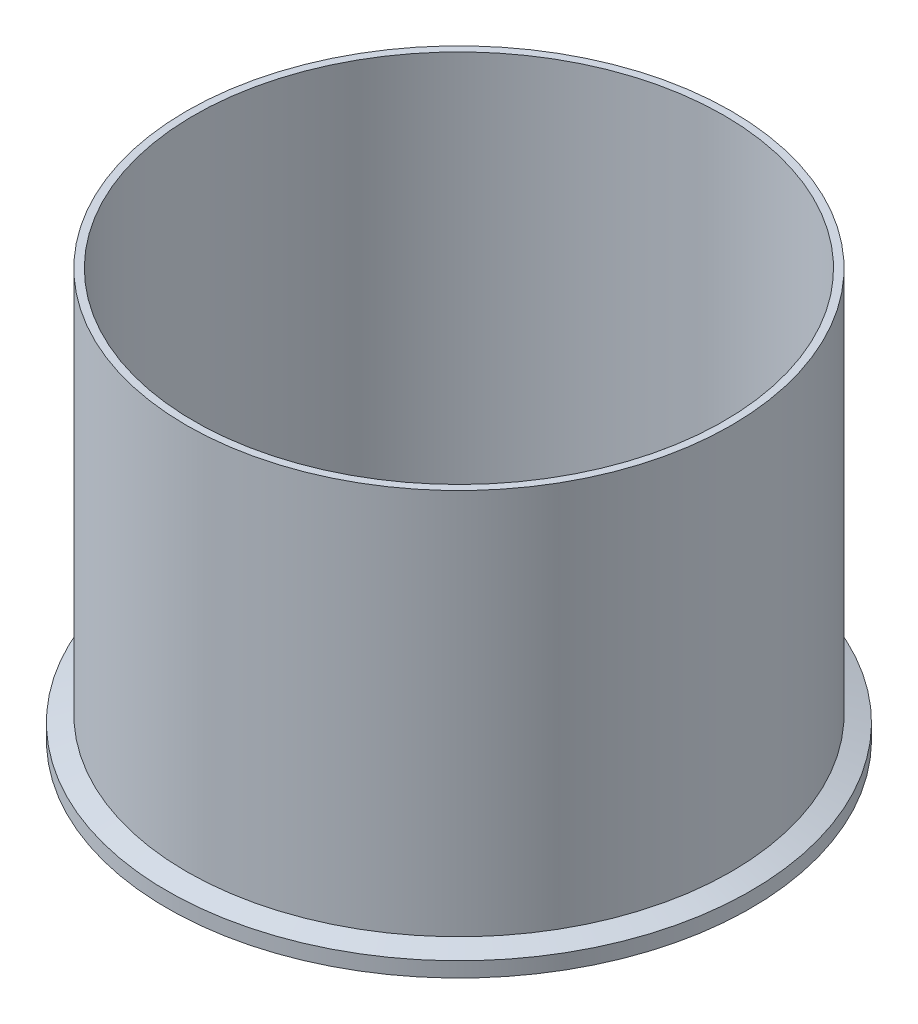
ISO-10303-21;
HEADER;
FILE_DESCRIPTION(('STEP AP214'),'2;1');
FILE_NAME('part.step','',(''),(''),'','','');
FILE_SCHEMA(('AUTOMOTIVE_DESIGN { 1 0 10303 214 1 1 1 1 }'));
ENDSEC;
DATA;
#1=APPLICATION_CONTEXT('core data for automotive mechanical design processes');
#2=APPLICATION_PROTOCOL_DEFINITION('international standard','automotive_design',2000,#1);
#3=PRODUCT_CONTEXT('',#1,'mechanical');
#4=PRODUCT('Part','Part','',(#3));
#5=PRODUCT_RELATED_PRODUCT_CATEGORY('part','',(#4));
#6=PRODUCT_DEFINITION_FORMATION('','',#4);
#7=PRODUCT_DEFINITION_CONTEXT('part definition',#1,'design');
#8=PRODUCT_DEFINITION('design','',#6,#7);
#9=PRODUCT_DEFINITION_SHAPE('','',#8);
#10=(LENGTH_UNIT() NAMED_UNIT(*) SI_UNIT(.MILLI.,.METRE.));
#11=(NAMED_UNIT(*) PLANE_ANGLE_UNIT() SI_UNIT($,.RADIAN.));
#12=(NAMED_UNIT(*) SI_UNIT($,.STERADIAN.) SOLID_ANGLE_UNIT());
#13=UNCERTAINTY_MEASURE_WITH_UNIT(LENGTH_MEASURE(1.E-05),#10,'distance_accuracy_value','');
#14=(GEOMETRIC_REPRESENTATION_CONTEXT(3) GLOBAL_UNCERTAINTY_ASSIGNED_CONTEXT((#13)) GLOBAL_UNIT_ASSIGNED_CONTEXT((#10,
#11,#12)) REPRESENTATION_CONTEXT('',''));
#15=CARTESIAN_POINT('',(0.,0.,0.));
#16=DIRECTION('',(0.,0.,1.));
#17=DIRECTION('',(1.,0.,0.));
#18=AXIS2_PLACEMENT_3D('',#15,#16,#17);
#19=CARTESIAN_POINT('',(0.,0.7874,0.));
#20=DIRECTION('',(0.,-1.,0.));
#21=DIRECTION('',(0.,0.,-1.));
#22=AXIS2_PLACEMENT_3D('',#19,#20,#21);
#23=TOROIDAL_SURFACE('',#22,105.399208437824,0.787400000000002);
#24=CARTESIAN_POINT('',(0.,0.,0.));
#25=DIRECTION('',(0.,-1.,0.));
#26=DIRECTION('',(0.,0.,-1.));
#27=AXIS2_PLACEMENT_3D('',#24,#25,#26);
#28=CIRCLE('',#27,105.399208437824);
#29=CARTESIAN_POINT('',(0.,0.,-105.399208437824));
#30=VERTEX_POINT('',#29);
#31=EDGE_CURVE('E66',#30,#30,#28,.T.);
#32=ORIENTED_EDGE('',*,*,#31,.T.);
#33=EDGE_LOOP('',(#32));
#34=FACE_BOUND('',#33,.T.);
#35=CARTESIAN_POINT('',(0.,0.474458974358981,0.));
#36=DIRECTION('',(0.,-1.,0.));
#37=DIRECTION('',(0.,0.,-1.));
#38=AXIS2_PLACEMENT_3D('',#35,#36,#37);
#39=CIRCLE('',#38,104.676666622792);
#40=CARTESIAN_POINT('',(0.,0.474458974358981,-104.676666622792));
#41=VERTEX_POINT('',#40);
#42=EDGE_CURVE('E10',#41,#41,#39,.T.);
#43=ORIENTED_EDGE('',*,*,#42,.F.);
#44=EDGE_LOOP('',(#43));
#45=FACE_BOUND('',#44,.T.);
#46=ADVANCED_FACE('F32',(#34,#45),#23,.T.);
#47=CARTESIAN_POINT('',(0.,0.,0.));
#48=DIRECTION('',(0.,-1.,0.));
#49=DIRECTION('',(0.,0.,-1.));
#50=AXIS2_PLACEMENT_3D('',#47,#48,#49);
#51=TOROIDAL_SURFACE('',#50,103.5812,1.1938);
#52=CARTESIAN_POINT('',(0.,0.474458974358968,0.));
#53=DIRECTION('',(0.,-1.,0.));
#54=DIRECTION('',(0.,0.,-1.));
#55=AXIS2_PLACEMENT_3D('',#52,#53,#54);
#56=CIRCLE('',#55,102.485733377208);
#57=CARTESIAN_POINT('',(0.,0.474458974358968,-102.485733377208));
#58=VERTEX_POINT('',#57);
#59=EDGE_CURVE('E38',#58,#58,#56,.T.);
#60=ORIENTED_EDGE('',*,*,#59,.F.);
#61=EDGE_LOOP('',(#60));
#62=FACE_BOUND('',#61,.T.);
#63=ORIENTED_EDGE('',*,*,#42,.T.);
#64=EDGE_LOOP('',(#63));
#65=FACE_BOUND('',#64,.T.);
#66=ADVANCED_FACE('F114',(#62,#65),#51,.F.);
#67=CARTESIAN_POINT('',(0.,0.7874,0.));
#68=DIRECTION('',(0.,-1.,0.));
#69=DIRECTION('',(0.,0.,-1.));
#70=AXIS2_PLACEMENT_3D('',#67,#68,#69);
#71=TOROIDAL_SURFACE('',#70,101.763191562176,0.787399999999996);
#72=ORIENTED_EDGE('',*,*,#59,.T.);
#73=EDGE_LOOP('',(#72));
#74=FACE_BOUND('',#73,.T.);
#75=CARTESIAN_POINT('',(0.,0.,0.));
#76=DIRECTION('',(0.,-1.,0.));
#77=DIRECTION('',(0.,0.,-1.));
#78=AXIS2_PLACEMENT_3D('',#75,#76,#77);
#79=CIRCLE('',#78,101.763191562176);
#80=CARTESIAN_POINT('',(0.,0.,-101.763191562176));
#81=VERTEX_POINT('',#80);
#82=EDGE_CURVE('E42',#81,#81,#79,.T.);
#83=ORIENTED_EDGE('',*,*,#82,.F.);
#84=EDGE_LOOP('',(#83));
#85=FACE_BOUND('',#84,.T.);
#86=ADVANCED_FACE('F110',(#74,#85),#71,.T.);
#87=CARTESIAN_POINT('',(0.,0.,0.));
#88=DIRECTION('',(0.,1.,0.));
#89=DIRECTION('',(0.,0.,1.));
#90=AXIS2_PLACEMENT_3D('',#87,#88,#89);
#91=PLANE('',#90);
#92=CARTESIAN_POINT('',(0.,0.,0.));
#93=DIRECTION('',(0.,-1.,0.));
#94=DIRECTION('',(0.,0.,-1.));
#95=AXIS2_PLACEMENT_3D('',#92,#93,#94);
#96=CIRCLE('',#95,98.8314);
#97=CARTESIAN_POINT('',(0.,0.,-98.8314));
#98=VERTEX_POINT('',#97);
#99=EDGE_CURVE('E46',#98,#98,#96,.T.);
#100=ORIENTED_EDGE('',*,*,#99,.F.);
#101=EDGE_LOOP('',(#100));
#102=FACE_BOUND('',#101,.T.);
#103=ORIENTED_EDGE('',*,*,#82,.T.);
#104=EDGE_LOOP('',(#103));
#105=FACE_BOUND('',#104,.T.);
#106=ADVANCED_FACE('F104',(#102,#105),#91,.F.);
#107=CARTESIAN_POINT('',(0.,0.,0.));
#108=DIRECTION('',(0.,-1.,0.));
#109=DIRECTION('',(0.,0.,-1.));
#110=AXIS2_PLACEMENT_3D('',#107,#108,#109);
#111=CYLINDRICAL_SURFACE('',#110,98.8314);
#112=ORIENTED_EDGE('',*,*,#99,.T.);
#113=EDGE_LOOP('',(#112));
#114=FACE_BOUND('',#113,.T.);
#115=CARTESIAN_POINT('',(0.,152.4,0.));
#116=DIRECTION('',(0.,-1.,0.));
#117=DIRECTION('',(0.,0.,-1.));
#118=AXIS2_PLACEMENT_3D('',#115,#116,#117);
#119=CIRCLE('',#118,98.8314);
#120=CARTESIAN_POINT('',(0.,152.4,-98.8314));
#121=VERTEX_POINT('',#120);
#122=EDGE_CURVE('E51',#121,#121,#119,.T.);
#123=ORIENTED_EDGE('',*,*,#122,.F.);
#124=EDGE_LOOP('',(#123));
#125=FACE_BOUND('',#124,.T.);
#126=ADVANCED_FACE('F99',(#114,#125),#111,.F.);
#127=CARTESIAN_POINT('',(0.,152.4,0.));
#128=DIRECTION('',(0.,-1.,0.));
#129=DIRECTION('',(0.,0.,-1.));
#130=AXIS2_PLACEMENT_3D('',#127,#128,#129);
#131=PLANE('',#130);
#132=CARTESIAN_POINT('',(0.,152.4,0.));
#133=DIRECTION('',(0.,-1.,0.));
#134=DIRECTION('',(0.,0.,-1.));
#135=AXIS2_PLACEMENT_3D('',#132,#133,#134);
#136=CIRCLE('',#135,101.6);
#137=CARTESIAN_POINT('',(0.,152.4,-101.6));
#138=VERTEX_POINT('',#137);
#139=EDGE_CURVE('E54',#138,#138,#136,.T.);
#140=ORIENTED_EDGE('',*,*,#139,.F.);
#141=EDGE_LOOP('',(#140));
#142=FACE_BOUND('',#141,.T.);
#143=ORIENTED_EDGE('',*,*,#122,.T.);
#144=EDGE_LOOP('',(#143));
#145=FACE_BOUND('',#144,.T.);
#146=ADVANCED_FACE('F93',(#142,#145),#131,.F.);
#147=CARTESIAN_POINT('',(0.,0.,0.));
#148=DIRECTION('',(0.,-1.,0.));
#149=DIRECTION('',(0.,0.,-1.));
#150=AXIS2_PLACEMENT_3D('',#147,#148,#149);
#151=CYLINDRICAL_SURFACE('',#150,101.6);
#152=CARTESIAN_POINT('',(0.,8.22278052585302,0.));
#153=DIRECTION('',(0.,-1.,0.));
#154=DIRECTION('',(0.,0.,-1.));
#155=AXIS2_PLACEMENT_3D('',#152,#153,#154);
#156=CIRCLE('',#155,101.6);
#157=CARTESIAN_POINT('',(0.,8.22278052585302,-101.6));
#158=VERTEX_POINT('',#157);
#159=EDGE_CURVE('E57',#158,#158,#156,.T.);
#160=ORIENTED_EDGE('',*,*,#159,.F.);
#161=EDGE_LOOP('',(#160));
#162=FACE_BOUND('',#161,.T.);
#163=ORIENTED_EDGE('',*,*,#139,.T.);
#164=EDGE_LOOP('',(#163));
#165=FACE_BOUND('',#164,.T.);
#166=ADVANCED_FACE('F87',(#162,#165),#151,.T.);
#167=CARTESIAN_POINT('',(0.,8.22278052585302,0.));
#168=DIRECTION('',(0.,-1.,0.));
#169=DIRECTION('',(0.,0.,-1.));
#170=AXIS2_PLACEMENT_3D('',#167,#168,#169);
#171=CONICAL_SURFACE('',#170,101.6,1.22173047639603);
#172=CARTESIAN_POINT('',(0.,5.588,0.));
#173=DIRECTION('',(0.,-1.,0.));
#174=DIRECTION('',(0.,0.,-1.));
#175=AXIS2_PLACEMENT_3D('',#172,#173,#174);
#176=CIRCLE('',#175,108.839);
#177=CARTESIAN_POINT('',(0.,5.588,-108.839));
#178=VERTEX_POINT('',#177);
#179=EDGE_CURVE('E60',#178,#178,#176,.T.);
#180=ORIENTED_EDGE('',*,*,#179,.F.);
#181=EDGE_LOOP('',(#180));
#182=FACE_BOUND('',#181,.T.);
#183=ORIENTED_EDGE('',*,*,#159,.T.);
#184=EDGE_LOOP('',(#183));
#185=FACE_BOUND('',#184,.T.);
#186=ADVANCED_FACE('F81',(#182,#185),#171,.T.);
#187=CARTESIAN_POINT('',(0.,0.,0.));
#188=DIRECTION('',(0.,-1.,0.));
#189=DIRECTION('',(0.,0.,-1.));
#190=AXIS2_PLACEMENT_3D('',#187,#188,#189);
#191=CYLINDRICAL_SURFACE('',#190,108.839);
#192=CARTESIAN_POINT('',(0.,0.,0.));
#193=DIRECTION('',(0.,-1.,0.));
#194=DIRECTION('',(0.,0.,-1.));
#195=AXIS2_PLACEMENT_3D('',#192,#193,#194);
#196=CIRCLE('',#195,108.839);
#197=CARTESIAN_POINT('',(0.,0.,-108.839));
#198=VERTEX_POINT('',#197);
#199=EDGE_CURVE('E63',#198,#198,#196,.T.);
#200=ORIENTED_EDGE('',*,*,#199,.F.);
#201=EDGE_LOOP('',(#200));
#202=FACE_BOUND('',#201,.T.);
#203=ORIENTED_EDGE('',*,*,#179,.T.);
#204=EDGE_LOOP('',(#203));
#205=FACE_BOUND('',#204,.T.);
#206=ADVANCED_FACE('F75',(#202,#205),#191,.T.);
#207=CARTESIAN_POINT('',(0.,0.,0.));
#208=DIRECTION('',(0.,1.,0.));
#209=DIRECTION('',(0.,0.,1.));
#210=AXIS2_PLACEMENT_3D('',#207,#208,#209);
#211=PLANE('',#210);
#212=ORIENTED_EDGE('',*,*,#31,.F.);
#213=EDGE_LOOP('',(#212));
#214=FACE_BOUND('',#213,.T.);
#215=ORIENTED_EDGE('',*,*,#199,.T.);
#216=EDGE_LOOP('',(#215));
#217=FACE_BOUND('',#216,.T.);
#218=ADVANCED_FACE('F72',(#214,#217),#211,.F.);
#219=CLOSED_SHELL('',(#46,#66,#86,#106,#126,#146,#166,#186,#206,#218));
#220=MANIFOLD_SOLID_BREP('B2',#219);
#221=ADVANCED_BREP_SHAPE_REPRESENTATION('',(#18,#220),#14);
#222=SHAPE_DEFINITION_REPRESENTATION(#9,#221);
ENDSEC;
END-ISO-10303-21;
